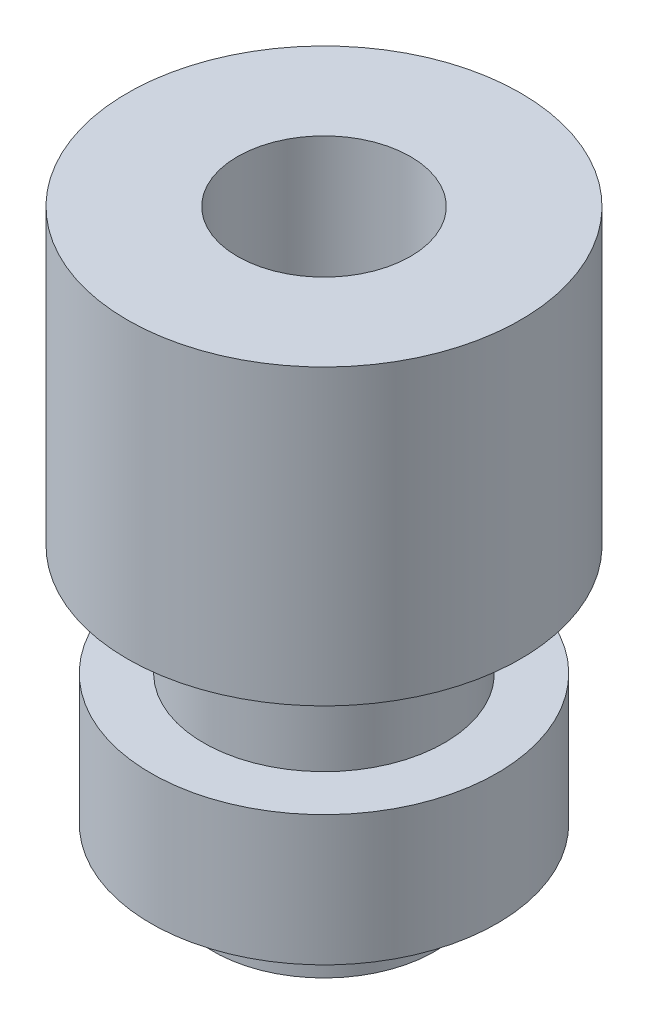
ISO-10303-21;
HEADER;
FILE_DESCRIPTION(('STEP AP214'),'2;1');
FILE_NAME('part.step','',(''),(''),'','','');
FILE_SCHEMA(('AUTOMOTIVE_DESIGN { 1 0 10303 214 1 1 1 1 }'));
ENDSEC;
DATA;
#1=APPLICATION_CONTEXT('core data for automotive mechanical design processes');
#2=APPLICATION_PROTOCOL_DEFINITION('international standard','automotive_design',2000,#1);
#3=PRODUCT_CONTEXT('',#1,'mechanical');
#4=PRODUCT('Part','Part','',(#3));
#5=PRODUCT_RELATED_PRODUCT_CATEGORY('part','',(#4));
#6=PRODUCT_DEFINITION_FORMATION('','',#4);
#7=PRODUCT_DEFINITION_CONTEXT('part definition',#1,'design');
#8=PRODUCT_DEFINITION('design','',#6,#7);
#9=PRODUCT_DEFINITION_SHAPE('','',#8);
#10=(LENGTH_UNIT() NAMED_UNIT(*) SI_UNIT(.MILLI.,.METRE.));
#11=(NAMED_UNIT(*) PLANE_ANGLE_UNIT() SI_UNIT($,.RADIAN.));
#12=(NAMED_UNIT(*) SI_UNIT($,.STERADIAN.) SOLID_ANGLE_UNIT());
#13=UNCERTAINTY_MEASURE_WITH_UNIT(LENGTH_MEASURE(1.E-05),#10,'distance_accuracy_value','');
#14=(GEOMETRIC_REPRESENTATION_CONTEXT(3) GLOBAL_UNCERTAINTY_ASSIGNED_CONTEXT((#13)) GLOBAL_UNIT_ASSIGNED_CONTEXT((#10,
#11,#12)) REPRESENTATION_CONTEXT('',''));
#15=CARTESIAN_POINT('',(0.,0.,0.));
#16=DIRECTION('',(0.,0.,1.));
#17=DIRECTION('',(1.,0.,0.));
#18=AXIS2_PLACEMENT_3D('',#15,#16,#17);
#19=CARTESIAN_POINT('',(0.,0.,-1.80411241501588E-13));
#20=DIRECTION('',(0.,-1.,0.));
#21=DIRECTION('',(0.,0.,-1.));
#22=AXIS2_PLACEMENT_3D('',#19,#20,#21);
#23=CYLINDRICAL_SURFACE('',#22,5.08);
#24=CARTESIAN_POINT('',(0.,0.,-1.80411241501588E-13));
#25=DIRECTION('',(0.,-1.,0.));
#26=DIRECTION('',(0.,0.,-1.));
#27=AXIS2_PLACEMENT_3D('',#24,#25,#26);
#28=CIRCLE('',#27,5.08);
#29=CARTESIAN_POINT('',(0.,0.,-5.08000000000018));
#30=VERTEX_POINT('',#29);
#31=EDGE_CURVE('E10',#30,#30,#28,.T.);
#32=ORIENTED_EDGE('',*,*,#31,.F.);
#33=EDGE_LOOP('',(#32));
#34=FACE_BOUND('',#33,.T.);
#35=CARTESIAN_POINT('',(0.,2.54,0.));
#36=DIRECTION('',(0.,-1.,0.));
#37=DIRECTION('',(0.,0.,-1.));
#38=AXIS2_PLACEMENT_3D('',#35,#36,#37);
#39=CIRCLE('',#38,5.08);
#40=CARTESIAN_POINT('',(0.,2.54,-5.08));
#41=VERTEX_POINT('',#40);
#42=EDGE_CURVE('E62',#41,#41,#39,.T.);
#43=ORIENTED_EDGE('',*,*,#42,.T.);
#44=EDGE_LOOP('',(#43));
#45=FACE_BOUND('',#44,.T.);
#46=ADVANCED_FACE('F28',(#34,#45),#23,.T.);
#47=CARTESIAN_POINT('',(-3.96874999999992,0.,0.));
#48=DIRECTION('',(0.,1.,0.));
#49=DIRECTION('',(0.,0.,1.));
#50=AXIS2_PLACEMENT_3D('',#47,#48,#49);
#51=PLANE('',#50);
#52=CARTESIAN_POINT('',(0.,0.,-1.80411241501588E-13));
#53=DIRECTION('',(0.,-1.,0.));
#54=DIRECTION('',(0.,0.,-1.));
#55=AXIS2_PLACEMENT_3D('',#52,#53,#54);
#56=CIRCLE('',#55,3.96875);
#57=CARTESIAN_POINT('',(0.,0.,-3.96875000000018));
#58=VERTEX_POINT('',#57);
#59=EDGE_CURVE('E34',#58,#58,#56,.T.);
#60=ORIENTED_EDGE('',*,*,#59,.F.);
#61=EDGE_LOOP('',(#60));
#62=FACE_BOUND('',#61,.T.);
#63=ORIENTED_EDGE('',*,*,#31,.T.);
#64=EDGE_LOOP('',(#63));
#65=FACE_BOUND('',#64,.T.);
#66=ADVANCED_FACE('F111',(#62,#65),#51,.F.);
#67=CARTESIAN_POINT('',(0.,0.,-1.80411241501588E-13));
#68=DIRECTION('',(0.,-1.,0.));
#69=DIRECTION('',(0.,0.,-1.));
#70=AXIS2_PLACEMENT_3D('',#67,#68,#69);
#71=CYLINDRICAL_SURFACE('',#70,3.96875);
#72=CARTESIAN_POINT('',(0.,27.051,0.));
#73=DIRECTION('',(0.,-1.,0.));
#74=DIRECTION('',(0.,0.,-1.));
#75=AXIS2_PLACEMENT_3D('',#72,#73,#74);
#76=CIRCLE('',#75,3.96875);
#77=CARTESIAN_POINT('',(0.,27.051,-3.96874999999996));
#78=VERTEX_POINT('',#77);
#79=EDGE_CURVE('E38',#78,#78,#76,.T.);
#80=ORIENTED_EDGE('',*,*,#79,.F.);
#81=EDGE_LOOP('',(#80));
#82=FACE_BOUND('',#81,.T.);
#83=ORIENTED_EDGE('',*,*,#59,.T.);
#84=EDGE_LOOP('',(#83));
#85=FACE_BOUND('',#84,.T.);
#86=ADVANCED_FACE('F106',(#82,#85),#71,.F.);
#87=CARTESIAN_POINT('',(-9.01699999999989,27.0510000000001,0.));
#88=DIRECTION('',(0.,-1.,0.));
#89=DIRECTION('',(0.,0.,-1.));
#90=AXIS2_PLACEMENT_3D('',#87,#88,#89);
#91=PLANE('',#90);
#92=CARTESIAN_POINT('',(0.,27.051,0.));
#93=DIRECTION('',(0.,-1.,0.));
#94=DIRECTION('',(0.,0.,-1.));
#95=AXIS2_PLACEMENT_3D('',#92,#93,#94);
#96=CIRCLE('',#95,9.017);
#97=CARTESIAN_POINT('',(0.,27.051,-9.01699999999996));
#98=VERTEX_POINT('',#97);
#99=EDGE_CURVE('E42',#98,#98,#96,.T.);
#100=ORIENTED_EDGE('',*,*,#99,.F.);
#101=EDGE_LOOP('',(#100));
#102=FACE_BOUND('',#101,.T.);
#103=ORIENTED_EDGE('',*,*,#79,.T.);
#104=EDGE_LOOP('',(#103));
#105=FACE_BOUND('',#104,.T.);
#106=ADVANCED_FACE('F100',(#102,#105),#91,.F.);
#107=CARTESIAN_POINT('',(0.,0.,-1.80411241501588E-13));
#108=DIRECTION('',(0.,-1.,0.));
#109=DIRECTION('',(0.,0.,-1.));
#110=AXIS2_PLACEMENT_3D('',#107,#108,#109);
#111=CYLINDRICAL_SURFACE('',#110,9.017);
#112=CARTESIAN_POINT('',(0.,13.589,0.));
#113=DIRECTION('',(0.,-1.,0.));
#114=DIRECTION('',(0.,0.,-1.));
#115=AXIS2_PLACEMENT_3D('',#112,#113,#114);
#116=CIRCLE('',#115,9.017);
#117=CARTESIAN_POINT('',(0.,13.589,-9.01700000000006));
#118=VERTEX_POINT('',#117);
#119=EDGE_CURVE('E47',#118,#118,#116,.T.);
#120=ORIENTED_EDGE('',*,*,#119,.F.);
#121=EDGE_LOOP('',(#120));
#122=FACE_BOUND('',#121,.T.);
#123=ORIENTED_EDGE('',*,*,#99,.T.);
#124=EDGE_LOOP('',(#123));
#125=FACE_BOUND('',#124,.T.);
#126=ADVANCED_FACE('F94',(#122,#125),#111,.T.);
#127=CARTESIAN_POINT('',(-5.52449999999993,13.589,-1.2490009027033E-13));
#128=DIRECTION('',(0.,1.,0.));
#129=DIRECTION('',(0.,0.,1.));
#130=AXIS2_PLACEMENT_3D('',#127,#128,#129);
#131=PLANE('',#130);
#132=CARTESIAN_POINT('',(0.,13.589,0.));
#133=DIRECTION('',(0.,-1.,0.));
#134=DIRECTION('',(0.,0.,-1.));
#135=AXIS2_PLACEMENT_3D('',#132,#133,#134);
#136=CIRCLE('',#135,5.5245);
#137=CARTESIAN_POINT('',(0.,13.589,-5.52450000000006));
#138=VERTEX_POINT('',#137);
#139=EDGE_CURVE('E50',#138,#138,#136,.T.);
#140=ORIENTED_EDGE('',*,*,#139,.F.);
#141=EDGE_LOOP('',(#140));
#142=FACE_BOUND('',#141,.T.);
#143=ORIENTED_EDGE('',*,*,#119,.T.);
#144=EDGE_LOOP('',(#143));
#145=FACE_BOUND('',#144,.T.);
#146=ADVANCED_FACE('F88',(#142,#145),#131,.F.);
#147=CARTESIAN_POINT('',(0.,0.,-1.80411241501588E-13));
#148=DIRECTION('',(0.,-1.,0.));
#149=DIRECTION('',(0.,0.,-1.));
#150=AXIS2_PLACEMENT_3D('',#147,#148,#149);
#151=CYLINDRICAL_SURFACE('',#150,5.5245);
#152=CARTESIAN_POINT('',(0.,8.509,0.));
#153=DIRECTION('',(0.,-1.,0.));
#154=DIRECTION('',(0.,0.,-1.));
#155=AXIS2_PLACEMENT_3D('',#152,#153,#154);
#156=CIRCLE('',#155,5.5245);
#157=CARTESIAN_POINT('',(0.,8.509,-5.5245));
#158=VERTEX_POINT('',#157);
#159=EDGE_CURVE('E53',#158,#158,#156,.T.);
#160=ORIENTED_EDGE('',*,*,#159,.F.);
#161=EDGE_LOOP('',(#160));
#162=FACE_BOUND('',#161,.T.);
#163=ORIENTED_EDGE('',*,*,#139,.T.);
#164=EDGE_LOOP('',(#163));
#165=FACE_BOUND('',#164,.T.);
#166=ADVANCED_FACE('F82',(#162,#165),#151,.T.);
#167=CARTESIAN_POINT('',(-7.93749999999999,8.50899999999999,0.));
#168=DIRECTION('',(0.,-1.,0.));
#169=DIRECTION('',(0.,0.,-1.));
#170=AXIS2_PLACEMENT_3D('',#167,#168,#169);
#171=PLANE('',#170);
#172=CARTESIAN_POINT('',(0.,8.509,0.));
#173=DIRECTION('',(0.,-1.,0.));
#174=DIRECTION('',(0.,0.,-1.));
#175=AXIS2_PLACEMENT_3D('',#172,#173,#174);
#176=CIRCLE('',#175,7.9375);
#177=CARTESIAN_POINT('',(0.,8.509,-7.9375));
#178=VERTEX_POINT('',#177);
#179=EDGE_CURVE('E56',#178,#178,#176,.T.);
#180=ORIENTED_EDGE('',*,*,#179,.F.);
#181=EDGE_LOOP('',(#180));
#182=FACE_BOUND('',#181,.T.);
#183=ORIENTED_EDGE('',*,*,#159,.T.);
#184=EDGE_LOOP('',(#183));
#185=FACE_BOUND('',#184,.T.);
#186=ADVANCED_FACE('F76',(#182,#185),#171,.F.);
#187=CARTESIAN_POINT('',(0.,0.,-1.80411241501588E-13));
#188=DIRECTION('',(0.,-1.,0.));
#189=DIRECTION('',(0.,0.,-1.));
#190=AXIS2_PLACEMENT_3D('',#187,#188,#189);
#191=CYLINDRICAL_SURFACE('',#190,7.9375);
#192=CARTESIAN_POINT('',(0.,2.54,0.));
#193=DIRECTION('',(0.,-1.,0.));
#194=DIRECTION('',(0.,0.,-1.));
#195=AXIS2_PLACEMENT_3D('',#192,#193,#194);
#196=CIRCLE('',#195,7.9375);
#197=CARTESIAN_POINT('',(0.,2.54,-7.9375));
#198=VERTEX_POINT('',#197);
#199=EDGE_CURVE('E59',#198,#198,#196,.T.);
#200=ORIENTED_EDGE('',*,*,#199,.F.);
#201=EDGE_LOOP('',(#200));
#202=FACE_BOUND('',#201,.T.);
#203=ORIENTED_EDGE('',*,*,#179,.T.);
#204=EDGE_LOOP('',(#203));
#205=FACE_BOUND('',#204,.T.);
#206=ADVANCED_FACE('F70',(#202,#205),#191,.T.);
#207=CARTESIAN_POINT('',(-5.07999999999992,2.54,-1.52655665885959E-13));
#208=DIRECTION('',(0.,1.,0.));
#209=DIRECTION('',(0.,0.,1.));
#210=AXIS2_PLACEMENT_3D('',#207,#208,#209);
#211=PLANE('',#210);
#212=ORIENTED_EDGE('',*,*,#42,.F.);
#213=EDGE_LOOP('',(#212));
#214=FACE_BOUND('',#213,.T.);
#215=ORIENTED_EDGE('',*,*,#199,.T.);
#216=EDGE_LOOP('',(#215));
#217=FACE_BOUND('',#216,.T.);
#218=ADVANCED_FACE('F67',(#214,#217),#211,.F.);
#219=CLOSED_SHELL('',(#46,#66,#86,#106,#126,#146,#166,#186,#206,#218));
#220=MANIFOLD_SOLID_BREP('B2',#219);
#221=ADVANCED_BREP_SHAPE_REPRESENTATION('',(#18,#220),#14);
#222=SHAPE_DEFINITION_REPRESENTATION(#9,#221);
ENDSEC;
END-ISO-10303-21;
